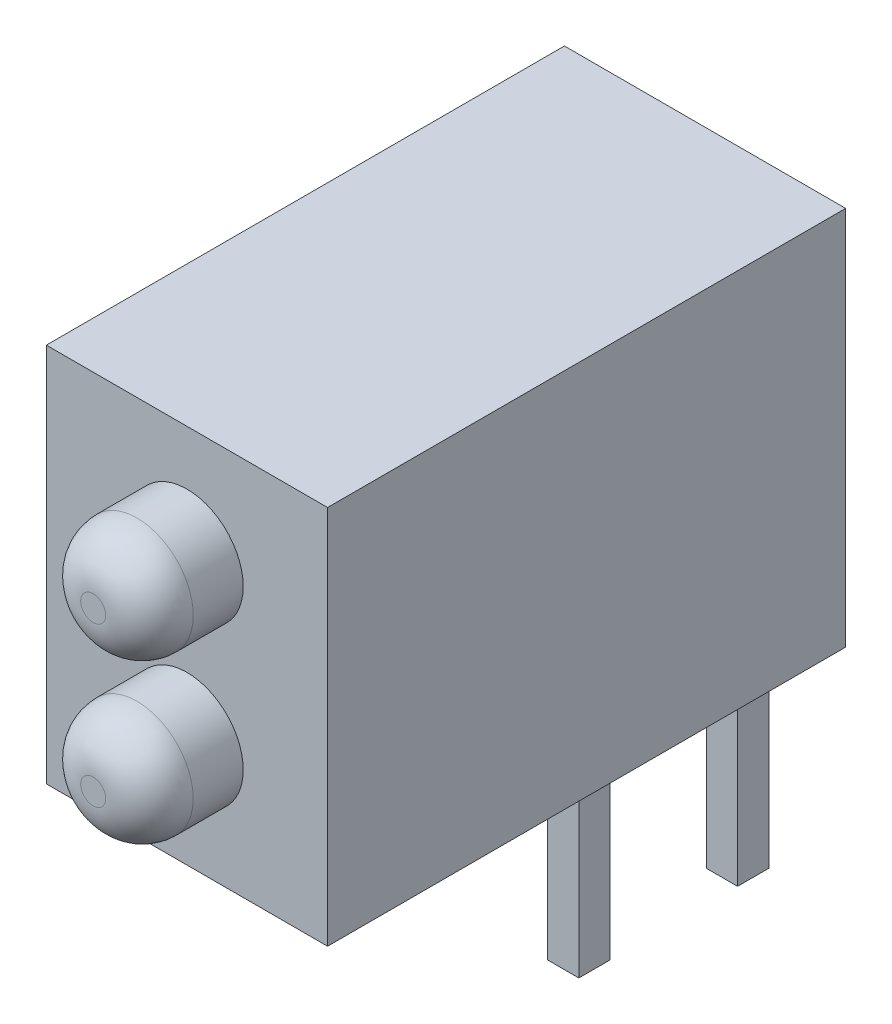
from build123d import *

# Parameters (mm, degrees)
SKETCH1_W           = 4.5
SKETCH1_H           = 6.08
BOSS_EXTRUDE1_DEPTH = 8.29
SKETCH2_R           = 0.9
BOSS_EXTRUDE2_DEPTH = 1.5
FILLET1_R           = 0.7
SKETCH3_W           = 0.5
SKETCH3_H           = 0.5
BOSS_EXTRUDE3_DEPTH = 3.18


with BuildPart() as part:
    # Sketch1 → Boss-Extrude1 (new body)
    with BuildSketch(Plane.XY):
        Rectangle(SKETCH1_W, SKETCH1_H)
    extrude(amount=-BOSS_EXTRUDE1_DEPTH)

    # Sketch2 → Boss-Extrude2 (add)
    with BuildSketch(Plane.XY):
        with Locations((0, 1.27)):
            Circle(SKETCH2_R)
        with Locations((0, -1.27)):
            Circle(SKETCH2_R)
    extrude(amount=BOSS_EXTRUDE2_DEPTH)

    # Fillet1
    fillet1_edges = [part.edges().sort_by_distance(p)[0] for p in [
        (-0.9, 1.27, 1.5),
        (-0.9, -1.27, 1.5),
    ]]
    fillet(fillet1_edges, radius=FILLET1_R)

    # Sketch3 → Boss-Extrude3 (add)
    with BuildSketch(Plane.XZ.offset(3.04)):
        with Locations((-1.27, -7.54)):
            Rectangle(SKETCH3_W, SKETCH3_H)
        with Locations((1.27, -7.54)):
            Rectangle(SKETCH3_W, SKETCH3_H)
        with Locations((-1.27, -5)):
            Rectangle(SKETCH3_W, SKETCH3_H)
        with Locations((1.27, -5)):
            Rectangle(SKETCH3_W, SKETCH3_H)
    extrude(amount=BOSS_EXTRUDE3_DEPTH)


solid = part.part
